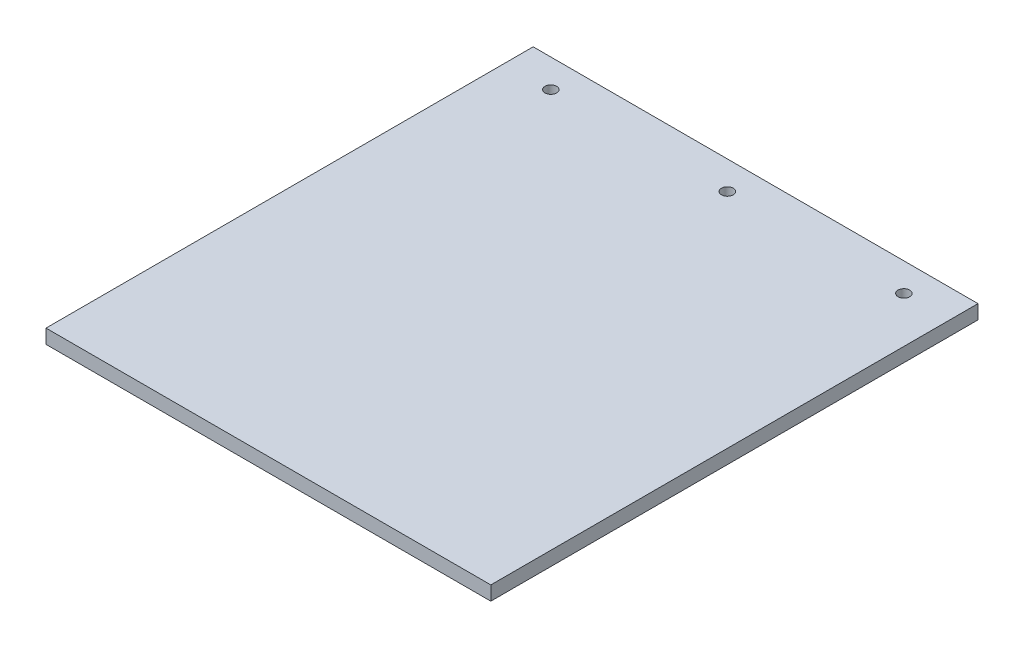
ISO-10303-21;
HEADER;
FILE_DESCRIPTION(('STEP AP214'),'2;1');
FILE_NAME('part.step','',(''),(''),'','','');
FILE_SCHEMA(('AUTOMOTIVE_DESIGN { 1 0 10303 214 1 1 1 1 }'));
ENDSEC;
DATA;
#1=APPLICATION_CONTEXT('core data for automotive mechanical design processes');
#2=APPLICATION_PROTOCOL_DEFINITION('international standard','automotive_design',2000,#1);
#3=PRODUCT_CONTEXT('',#1,'mechanical');
#4=PRODUCT('Part','Part','',(#3));
#5=PRODUCT_RELATED_PRODUCT_CATEGORY('part','',(#4));
#6=PRODUCT_DEFINITION_FORMATION('','',#4);
#7=PRODUCT_DEFINITION_CONTEXT('part definition',#1,'design');
#8=PRODUCT_DEFINITION('design','',#6,#7);
#9=PRODUCT_DEFINITION_SHAPE('','',#8);
#10=(LENGTH_UNIT() NAMED_UNIT(*) SI_UNIT(.MILLI.,.METRE.));
#11=(NAMED_UNIT(*) PLANE_ANGLE_UNIT() SI_UNIT($,.RADIAN.));
#12=(NAMED_UNIT(*) SI_UNIT($,.STERADIAN.) SOLID_ANGLE_UNIT());
#13=UNCERTAINTY_MEASURE_WITH_UNIT(LENGTH_MEASURE(1.E-05),#10,'distance_accuracy_value','');
#14=(GEOMETRIC_REPRESENTATION_CONTEXT(3) GLOBAL_UNCERTAINTY_ASSIGNED_CONTEXT((#13)) GLOBAL_UNIT_ASSIGNED_CONTEXT((#10,
#11,#12)) REPRESENTATION_CONTEXT('',''));
#15=CARTESIAN_POINT('',(0.,0.,0.));
#16=DIRECTION('',(0.,0.,1.));
#17=DIRECTION('',(1.,0.,0.));
#18=AXIS2_PLACEMENT_3D('',#15,#16,#17);
#19=CARTESIAN_POINT('',(0.,0.,0.));
#20=DIRECTION('',(0.,-1.,0.));
#21=DIRECTION('',(0.,0.,-1.));
#22=AXIS2_PLACEMENT_3D('',#19,#20,#21);
#23=PLANE('',#22);
#24=CARTESIAN_POINT('',(13.0000000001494,0.,-129.999999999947));
#25=DIRECTION('',(0.,-1.,0.));
#26=DIRECTION('',(0.,0.,-1.));
#27=AXIS2_PLACEMENT_3D('',#24,#25,#26);
#28=CIRCLE('',#27,1.65);
#29=CARTESIAN_POINT('',(13.0000000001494,0.,-131.649999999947));
#30=VERTEX_POINT('',#29);
#31=EDGE_CURVE('E106',#30,#30,#28,.T.);
#32=ORIENTED_EDGE('',*,*,#31,.F.);
#33=EDGE_LOOP('',(#32));
#34=FACE_BOUND('',#33,.T.);
#35=CARTESIAN_POINT('',(63.0000000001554,0.,-129.999999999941));
#36=DIRECTION('',(0.,-1.,0.));
#37=DIRECTION('',(0.,0.,-1.));
#38=AXIS2_PLACEMENT_3D('',#35,#36,#37);
#39=CIRCLE('',#38,1.65);
#40=CARTESIAN_POINT('',(63.0000000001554,0.,-131.649999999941));
#41=VERTEX_POINT('',#40);
#42=EDGE_CURVE('E116',#41,#41,#39,.T.);
#43=ORIENTED_EDGE('',*,*,#42,.F.);
#44=EDGE_LOOP('',(#43));
#45=FACE_BOUND('',#44,.T.);
#46=CARTESIAN_POINT('',(113.000000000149,0.,-129.999999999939));
#47=DIRECTION('',(0.,-1.,0.));
#48=DIRECTION('',(0.,0.,-1.));
#49=AXIS2_PLACEMENT_3D('',#46,#47,#48);
#50=CIRCLE('',#49,1.65);
#51=CARTESIAN_POINT('',(113.000000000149,0.,-131.649999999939));
#52=VERTEX_POINT('',#51);
#53=EDGE_CURVE('E117',#52,#52,#50,.T.);
#54=ORIENTED_EDGE('',*,*,#53,.F.);
#55=EDGE_LOOP('',(#54));
#56=FACE_BOUND('',#55,.T.);
#57=DIRECTION('',(0.,0.,1.));
#58=VECTOR('',#57,1.);
#59=CARTESIAN_POINT('',(0.,0.,0.));
#60=LINE('',#59,#58);
#61=CARTESIAN_POINT('',(0.,0.,-138.));
#62=VERTEX_POINT('',#61);
#63=CARTESIAN_POINT('',(0.,0.,0.));
#64=VERTEX_POINT('',#63);
#65=EDGE_CURVE('E99',#62,#64,#60,.T.);
#66=ORIENTED_EDGE('',*,*,#65,.F.);
#67=DIRECTION('',(-1.,0.,0.));
#68=VECTOR('',#67,1.);
#69=CARTESIAN_POINT('',(0.,0.,-138.));
#70=LINE('',#69,#68);
#71=CARTESIAN_POINT('',(126.,0.,-138.));
#72=VERTEX_POINT('',#71);
#73=EDGE_CURVE('E26',#72,#62,#70,.T.);
#74=ORIENTED_EDGE('',*,*,#73,.F.);
#75=DIRECTION('',(0.,0.,-1.));
#76=VECTOR('',#75,1.);
#77=CARTESIAN_POINT('',(126.,0.,0.));
#78=LINE('',#77,#76);
#79=CARTESIAN_POINT('',(126.,0.,0.));
#80=VERTEX_POINT('',#79);
#81=EDGE_CURVE('E59',#80,#72,#78,.T.);
#82=ORIENTED_EDGE('',*,*,#81,.F.);
#83=DIRECTION('',(1.,0.,0.));
#84=VECTOR('',#83,1.);
#85=CARTESIAN_POINT('',(0.,0.,0.));
#86=LINE('',#85,#84);
#87=EDGE_CURVE('E134',#64,#80,#86,.T.);
#88=ORIENTED_EDGE('',*,*,#87,.F.);
#89=EDGE_LOOP('',(#66,#74,#82,#88));
#90=FACE_BOUND('',#89,.T.);
#91=ADVANCED_FACE('F17',(#34,#45,#56,#90),#23,.T.);
#92=CARTESIAN_POINT('',(0.,4.,0.));
#93=DIRECTION('',(0.,-1.,0.));
#94=DIRECTION('',(0.,0.,-1.));
#95=AXIS2_PLACEMENT_3D('',#92,#93,#94);
#96=PLANE('',#95);
#97=CARTESIAN_POINT('',(13.0000000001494,4.,-129.999999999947));
#98=DIRECTION('',(0.,-1.,0.));
#99=DIRECTION('',(0.,0.,-1.));
#100=AXIS2_PLACEMENT_3D('',#97,#98,#99);
#101=CIRCLE('',#100,1.65);
#102=CARTESIAN_POINT('',(13.0000000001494,4.,-131.649999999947));
#103=VERTEX_POINT('',#102);
#104=EDGE_CURVE('E112',#103,#103,#101,.T.);
#105=ORIENTED_EDGE('',*,*,#104,.T.);
#106=EDGE_LOOP('',(#105));
#107=FACE_BOUND('',#106,.T.);
#108=CARTESIAN_POINT('',(63.0000000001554,4.,-129.999999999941));
#109=DIRECTION('',(0.,-1.,0.));
#110=DIRECTION('',(0.,0.,-1.));
#111=AXIS2_PLACEMENT_3D('',#108,#109,#110);
#112=CIRCLE('',#111,1.65);
#113=CARTESIAN_POINT('',(63.0000000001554,4.,-131.649999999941));
#114=VERTEX_POINT('',#113);
#115=EDGE_CURVE('E121',#114,#114,#112,.T.);
#116=ORIENTED_EDGE('',*,*,#115,.T.);
#117=EDGE_LOOP('',(#116));
#118=FACE_BOUND('',#117,.T.);
#119=CARTESIAN_POINT('',(113.000000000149,4.,-129.999999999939));
#120=DIRECTION('',(0.,-1.,0.));
#121=DIRECTION('',(0.,0.,-1.));
#122=AXIS2_PLACEMENT_3D('',#119,#120,#121);
#123=CIRCLE('',#122,1.65);
#124=CARTESIAN_POINT('',(113.000000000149,4.,-131.649999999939));
#125=VERTEX_POINT('',#124);
#126=EDGE_CURVE('E122',#125,#125,#123,.T.);
#127=ORIENTED_EDGE('',*,*,#126,.T.);
#128=EDGE_LOOP('',(#127));
#129=FACE_BOUND('',#128,.T.);
#130=DIRECTION('',(0.,0.,1.));
#131=VECTOR('',#130,1.);
#132=CARTESIAN_POINT('',(0.,4.,0.));
#133=LINE('',#132,#131);
#134=CARTESIAN_POINT('',(0.,4.,-138.));
#135=VERTEX_POINT('',#134);
#136=CARTESIAN_POINT('',(0.,4.,0.));
#137=VERTEX_POINT('',#136);
#138=EDGE_CURVE('E90',#135,#137,#133,.T.);
#139=ORIENTED_EDGE('',*,*,#138,.T.);
#140=DIRECTION('',(1.,0.,0.));
#141=VECTOR('',#140,1.);
#142=CARTESIAN_POINT('',(0.,4.,0.));
#143=LINE('',#142,#141);
#144=CARTESIAN_POINT('',(126.,4.,0.));
#145=VERTEX_POINT('',#144);
#146=EDGE_CURVE('E78',#137,#145,#143,.T.);
#147=ORIENTED_EDGE('',*,*,#146,.T.);
#148=DIRECTION('',(0.,0.,-1.));
#149=VECTOR('',#148,1.);
#150=CARTESIAN_POINT('',(126.,4.,0.));
#151=LINE('',#150,#149);
#152=CARTESIAN_POINT('',(126.,4.,-138.));
#153=VERTEX_POINT('',#152);
#154=EDGE_CURVE('E70',#145,#153,#151,.T.);
#155=ORIENTED_EDGE('',*,*,#154,.T.);
#156=DIRECTION('',(-1.,0.,0.));
#157=VECTOR('',#156,1.);
#158=CARTESIAN_POINT('',(0.,4.,-138.));
#159=LINE('',#158,#157);
#160=EDGE_CURVE('E11',#153,#135,#159,.T.);
#161=ORIENTED_EDGE('',*,*,#160,.T.);
#162=EDGE_LOOP('',(#139,#147,#155,#161));
#163=FACE_BOUND('',#162,.T.);
#164=ADVANCED_FACE('F91',(#107,#118,#129,#163),#96,.F.);
#165=CARTESIAN_POINT('',(0.,4.,-138.));
#166=DIRECTION('',(0.,0.,1.));
#167=DIRECTION('',(1.,0.,0.));
#168=AXIS2_PLACEMENT_3D('',#165,#166,#167);
#169=PLANE('',#168);
#170=ORIENTED_EDGE('',*,*,#73,.T.);
#171=DIRECTION('',(0.,-1.,0.));
#172=VECTOR('',#171,1.);
#173=CARTESIAN_POINT('',(0.,4.,-138.));
#174=LINE('',#173,#172);
#175=EDGE_CURVE('E95',#135,#62,#174,.T.);
#176=ORIENTED_EDGE('',*,*,#175,.F.);
#177=ORIENTED_EDGE('',*,*,#160,.F.);
#178=DIRECTION('',(0.,-1.,0.));
#179=VECTOR('',#178,1.);
#180=CARTESIAN_POINT('',(126.,4.,-138.));
#181=LINE('',#180,#179);
#182=EDGE_CURVE('E110',#153,#72,#181,.T.);
#183=ORIENTED_EDGE('',*,*,#182,.T.);
#184=EDGE_LOOP('',(#170,#176,#177,#183));
#185=FACE_BOUND('',#184,.T.);
#186=ADVANCED_FACE('F146',(#185),#169,.F.);
#187=CARTESIAN_POINT('',(126.,4.,0.));
#188=DIRECTION('',(-1.,0.,0.));
#189=DIRECTION('',(0.,0.,1.));
#190=AXIS2_PLACEMENT_3D('',#187,#188,#189);
#191=PLANE('',#190);
#192=ORIENTED_EDGE('',*,*,#81,.T.);
#193=ORIENTED_EDGE('',*,*,#182,.F.);
#194=ORIENTED_EDGE('',*,*,#154,.F.);
#195=DIRECTION('',(0.,-1.,0.));
#196=VECTOR('',#195,1.);
#197=CARTESIAN_POINT('',(126.,4.,0.));
#198=LINE('',#197,#196);
#199=EDGE_CURVE('E85',#145,#80,#198,.T.);
#200=ORIENTED_EDGE('',*,*,#199,.T.);
#201=EDGE_LOOP('',(#192,#193,#194,#200));
#202=FACE_BOUND('',#201,.T.);
#203=ADVANCED_FACE('F280',(#202),#191,.F.);
#204=CARTESIAN_POINT('',(0.,4.,0.));
#205=DIRECTION('',(0.,0.,-1.));
#206=DIRECTION('',(0.,-1.,0.));
#207=AXIS2_PLACEMENT_3D('',#204,#205,#206);
#208=PLANE('',#207);
#209=ORIENTED_EDGE('',*,*,#87,.T.);
#210=ORIENTED_EDGE('',*,*,#199,.F.);
#211=ORIENTED_EDGE('',*,*,#146,.F.);
#212=DIRECTION('',(0.,-1.,0.));
#213=VECTOR('',#212,1.);
#214=CARTESIAN_POINT('',(0.,4.,0.));
#215=LINE('',#214,#213);
#216=EDGE_CURVE('E83',#137,#64,#215,.T.);
#217=ORIENTED_EDGE('',*,*,#216,.T.);
#218=EDGE_LOOP('',(#209,#210,#211,#217));
#219=FACE_BOUND('',#218,.T.);
#220=ADVANCED_FACE('F81',(#219),#208,.F.);
#221=CARTESIAN_POINT('',(0.,4.,0.));
#222=DIRECTION('',(1.,0.,0.));
#223=DIRECTION('',(0.,1.,0.));
#224=AXIS2_PLACEMENT_3D('',#221,#222,#223);
#225=PLANE('',#224);
#226=ORIENTED_EDGE('',*,*,#65,.T.);
#227=ORIENTED_EDGE('',*,*,#216,.F.);
#228=ORIENTED_EDGE('',*,*,#138,.F.);
#229=ORIENTED_EDGE('',*,*,#175,.T.);
#230=EDGE_LOOP('',(#226,#227,#228,#229));
#231=FACE_BOUND('',#230,.T.);
#232=ADVANCED_FACE('F97',(#231),#225,.F.);
#233=CARTESIAN_POINT('',(13.0000000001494,4.,-129.999999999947));
#234=DIRECTION('',(0.,-1.,0.));
#235=DIRECTION('',(0.,0.,-1.));
#236=AXIS2_PLACEMENT_3D('',#233,#234,#235);
#237=CYLINDRICAL_SURFACE('',#236,1.65);
#238=ORIENTED_EDGE('',*,*,#31,.T.);
#239=EDGE_LOOP('',(#238));
#240=FACE_BOUND('',#239,.T.);
#241=ORIENTED_EDGE('',*,*,#104,.F.);
#242=EDGE_LOOP('',(#241));
#243=FACE_BOUND('',#242,.T.);
#244=ADVANCED_FACE('F211',(#240,#243),#237,.F.);
#245=CARTESIAN_POINT('',(63.0000000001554,4.,-129.999999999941));
#246=DIRECTION('',(0.,-1.,0.));
#247=DIRECTION('',(0.,0.,-1.));
#248=AXIS2_PLACEMENT_3D('',#245,#246,#247);
#249=CYLINDRICAL_SURFACE('',#248,1.65);
#250=ORIENTED_EDGE('',*,*,#42,.T.);
#251=EDGE_LOOP('',(#250));
#252=FACE_BOUND('',#251,.T.);
#253=ORIENTED_EDGE('',*,*,#115,.F.);
#254=EDGE_LOOP('',(#253));
#255=FACE_BOUND('',#254,.T.);
#256=ADVANCED_FACE('F164',(#252,#255),#249,.F.);
#257=CARTESIAN_POINT('',(113.000000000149,4.,-129.999999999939));
#258=DIRECTION('',(0.,-1.,0.));
#259=DIRECTION('',(0.,0.,-1.));
#260=AXIS2_PLACEMENT_3D('',#257,#258,#259);
#261=CYLINDRICAL_SURFACE('',#260,1.65);
#262=ORIENTED_EDGE('',*,*,#53,.T.);
#263=EDGE_LOOP('',(#262));
#264=FACE_BOUND('',#263,.T.);
#265=ORIENTED_EDGE('',*,*,#126,.F.);
#266=EDGE_LOOP('',(#265));
#267=FACE_BOUND('',#266,.T.);
#268=ADVANCED_FACE('F161',(#264,#267),#261,.F.);
#269=CLOSED_SHELL('',(#91,#164,#186,#203,#220,#232,#244,#256,#268));
#270=MANIFOLD_SOLID_BREP('B1',#269);
#271=ADVANCED_BREP_SHAPE_REPRESENTATION('',(#18,#270),#14);
#272=SHAPE_DEFINITION_REPRESENTATION(#9,#271);
ENDSEC;
END-ISO-10303-21;
